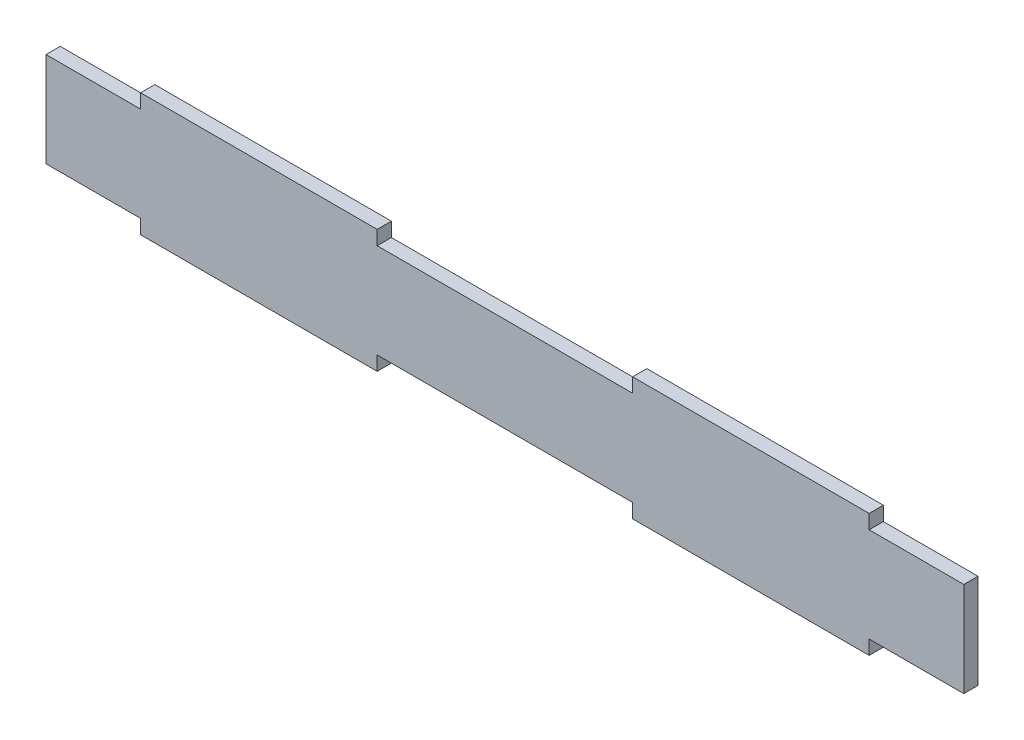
from build123d import *

# Parameters (mm, degrees)
SKETCH1_W           = 194
SKETCH1_H           = 20
SKETCH1_W_2         = 50
SKETCH1_H_2         = 3
BOSS_EXTRUDE1_DEPTH = 3


with BuildPart() as part:
    # Sketch1 → Boss-Extrude1 (new body)
    with BuildSketch(Plane.XY):
        with Locations((97, 10)):
            Rectangle(SKETCH1_W, SKETCH1_H)
        with Locations((45, 21.5)):
            Rectangle(SKETCH1_W_2, SKETCH1_H_2)
        with Locations((149, 21.5)):
            Rectangle(SKETCH1_W_2, SKETCH1_H_2)
        with Locations((149, -1.5)):
            Rectangle(SKETCH1_W_2, SKETCH1_H_2)
        with Locations((45, -1.5)):
            Rectangle(SKETCH1_W_2, SKETCH1_H_2)
    extrude(amount=BOSS_EXTRUDE1_DEPTH)


solid = part.part
